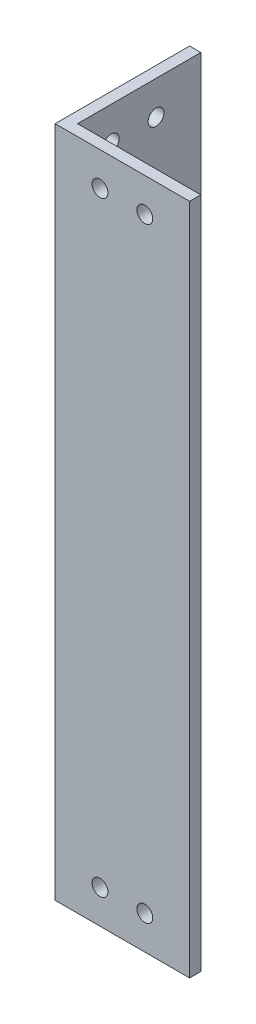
ISO-10303-21;
HEADER;
FILE_DESCRIPTION(('STEP AP214'),'2;1');
FILE_NAME('part.step','',(''),(''),'','','');
FILE_SCHEMA(('AUTOMOTIVE_DESIGN { 1 0 10303 214 1 1 1 1 }'));
ENDSEC;
DATA;
#1=APPLICATION_CONTEXT('core data for automotive mechanical design processes');
#2=APPLICATION_PROTOCOL_DEFINITION('international standard','automotive_design',2000,#1);
#3=PRODUCT_CONTEXT('',#1,'mechanical');
#4=PRODUCT('Part','Part','',(#3));
#5=PRODUCT_RELATED_PRODUCT_CATEGORY('part','',(#4));
#6=PRODUCT_DEFINITION_FORMATION('','',#4);
#7=PRODUCT_DEFINITION_CONTEXT('part definition',#1,'design');
#8=PRODUCT_DEFINITION('design','',#6,#7);
#9=PRODUCT_DEFINITION_SHAPE('','',#8);
#10=(LENGTH_UNIT() NAMED_UNIT(*) SI_UNIT(.MILLI.,.METRE.));
#11=(NAMED_UNIT(*) PLANE_ANGLE_UNIT() SI_UNIT($,.RADIAN.));
#12=(NAMED_UNIT(*) SI_UNIT($,.STERADIAN.) SOLID_ANGLE_UNIT());
#13=UNCERTAINTY_MEASURE_WITH_UNIT(LENGTH_MEASURE(1.E-05),#10,'distance_accuracy_value','');
#14=(GEOMETRIC_REPRESENTATION_CONTEXT(3) GLOBAL_UNCERTAINTY_ASSIGNED_CONTEXT((#13)) GLOBAL_UNIT_ASSIGNED_CONTEXT((#10,
#11,#12)) REPRESENTATION_CONTEXT('',''));
#15=CARTESIAN_POINT('',(0.,0.,0.));
#16=DIRECTION('',(0.,0.,1.));
#17=DIRECTION('',(1.,0.,0.));
#18=AXIS2_PLACEMENT_3D('',#15,#16,#17);
#19=CARTESIAN_POINT('',(0.,190.5,0.));
#20=DIRECTION('',(1.,0.,0.));
#21=DIRECTION('',(0.,0.,-1.));
#22=AXIS2_PLACEMENT_3D('',#19,#20,#21);
#23=PLANE('',#22);
#24=DIRECTION('',(0.,0.,1.));
#25=VECTOR('',#24,1.);
#26=CARTESIAN_POINT('',(0.,0.,0.));
#27=LINE('',#26,#25);
#28=CARTESIAN_POINT('',(0.,0.,-38.1));
#29=VERTEX_POINT('',#28);
#30=CARTESIAN_POINT('',(0.,0.,0.));
#31=VERTEX_POINT('',#30);
#32=EDGE_CURVE('E79',#29,#31,#27,.T.);
#33=ORIENTED_EDGE('',*,*,#32,.T.);
#34=DIRECTION('',(0.,-1.,0.));
#35=VECTOR('',#34,1.);
#36=CARTESIAN_POINT('',(0.,190.5,0.));
#37=LINE('',#36,#35);
#38=CARTESIAN_POINT('',(0.,190.5,0.));
#39=VERTEX_POINT('',#38);
#40=EDGE_CURVE('E114',#39,#31,#37,.T.);
#41=ORIENTED_EDGE('',*,*,#40,.F.);
#42=DIRECTION('',(0.,0.,1.));
#43=VECTOR('',#42,1.);
#44=CARTESIAN_POINT('',(0.,190.5,0.));
#45=LINE('',#44,#43);
#46=CARTESIAN_POINT('',(0.,190.5,-38.1));
#47=VERTEX_POINT('',#46);
#48=EDGE_CURVE('E50',#47,#39,#45,.T.);
#49=ORIENTED_EDGE('',*,*,#48,.F.);
#50=DIRECTION('',(0.,-1.,0.));
#51=VECTOR('',#50,1.);
#52=CARTESIAN_POINT('',(0.,190.5,-38.1));
#53=LINE('',#52,#51);
#54=EDGE_CURVE('E110',#47,#29,#53,.T.);
#55=ORIENTED_EDGE('',*,*,#54,.T.);
#56=EDGE_LOOP('',(#33,#41,#49,#55));
#57=FACE_BOUND('',#56,.T.);
#58=CARTESIAN_POINT('',(0.,9.525,-25.4));
#59=DIRECTION('',(-1.,0.,0.));
#60=DIRECTION('',(0.,0.,1.));
#61=AXIS2_PLACEMENT_3D('',#58,#59,#60);
#62=CIRCLE('',#61,2.24789999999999);
#63=CARTESIAN_POINT('',(0.,9.525,-23.1521));
#64=VERTEX_POINT('',#63);
#65=EDGE_CURVE('E148',#64,#64,#62,.T.);
#66=ORIENTED_EDGE('',*,*,#65,.F.);
#67=EDGE_LOOP('',(#66));
#68=FACE_BOUND('',#67,.T.);
#69=CARTESIAN_POINT('',(0.,9.525,-12.7));
#70=DIRECTION('',(-1.,0.,0.));
#71=DIRECTION('',(0.,0.,1.));
#72=AXIS2_PLACEMENT_3D('',#69,#70,#71);
#73=CIRCLE('',#72,2.24789999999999);
#74=CARTESIAN_POINT('',(0.,9.525,-10.4521));
#75=VERTEX_POINT('',#74);
#76=EDGE_CURVE('E152',#75,#75,#73,.T.);
#77=ORIENTED_EDGE('',*,*,#76,.F.);
#78=EDGE_LOOP('',(#77));
#79=FACE_BOUND('',#78,.T.);
#80=CARTESIAN_POINT('',(0.,180.975,-25.4));
#81=DIRECTION('',(-1.,0.,0.));
#82=DIRECTION('',(0.,0.,1.));
#83=AXIS2_PLACEMENT_3D('',#80,#81,#82);
#84=CIRCLE('',#83,2.2479);
#85=CARTESIAN_POINT('',(0.,180.975,-23.1521));
#86=VERTEX_POINT('',#85);
#87=EDGE_CURVE('E156',#86,#86,#84,.T.);
#88=ORIENTED_EDGE('',*,*,#87,.F.);
#89=EDGE_LOOP('',(#88));
#90=FACE_BOUND('',#89,.T.);
#91=CARTESIAN_POINT('',(0.,180.975,-12.7));
#92=DIRECTION('',(-1.,0.,0.));
#93=DIRECTION('',(0.,0.,1.));
#94=AXIS2_PLACEMENT_3D('',#91,#92,#93);
#95=CIRCLE('',#94,2.2479);
#96=CARTESIAN_POINT('',(0.,180.975,-10.4521));
#97=VERTEX_POINT('',#96);
#98=EDGE_CURVE('E159',#97,#97,#95,.T.);
#99=ORIENTED_EDGE('',*,*,#98,.F.);
#100=EDGE_LOOP('',(#99));
#101=FACE_BOUND('',#100,.T.);
#102=ADVANCED_FACE('F33',(#57,#68,#79,#90,#101),#23,.F.);
#103=CARTESIAN_POINT('',(38.1,190.5,0.));
#104=DIRECTION('',(0.,0.,-1.));
#105=DIRECTION('',(-1.,0.,0.));
#106=AXIS2_PLACEMENT_3D('',#103,#104,#105);
#107=PLANE('',#106);
#108=CARTESIAN_POINT('',(12.7,180.975,0.));
#109=DIRECTION('',(0.,0.,1.));
#110=DIRECTION('',(1.,0.,0.));
#111=AXIS2_PLACEMENT_3D('',#108,#109,#110);
#112=CIRCLE('',#111,2.24789999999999);
#113=CARTESIAN_POINT('',(14.9479,180.975,0.));
#114=VERTEX_POINT('',#113);
#115=EDGE_CURVE('E170',#114,#114,#112,.T.);
#116=ORIENTED_EDGE('',*,*,#115,.F.);
#117=EDGE_LOOP('',(#116));
#118=FACE_BOUND('',#117,.T.);
#119=CARTESIAN_POINT('',(25.4,180.975,0.));
#120=DIRECTION('',(0.,0.,1.));
#121=DIRECTION('',(1.,0.,0.));
#122=AXIS2_PLACEMENT_3D('',#119,#120,#121);
#123=CIRCLE('',#122,2.24789999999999);
#124=CARTESIAN_POINT('',(27.6479,180.975,0.));
#125=VERTEX_POINT('',#124);
#126=EDGE_CURVE('E176',#125,#125,#123,.T.);
#127=ORIENTED_EDGE('',*,*,#126,.F.);
#128=EDGE_LOOP('',(#127));
#129=FACE_BOUND('',#128,.T.);
#130=CARTESIAN_POINT('',(12.7,9.525,0.));
#131=DIRECTION('',(0.,0.,1.));
#132=DIRECTION('',(1.,0.,0.));
#133=AXIS2_PLACEMENT_3D('',#130,#131,#132);
#134=CIRCLE('',#133,2.24789999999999);
#135=CARTESIAN_POINT('',(14.9479,9.525,0.));
#136=VERTEX_POINT('',#135);
#137=EDGE_CURVE('E190',#136,#136,#134,.T.);
#138=ORIENTED_EDGE('',*,*,#137,.F.);
#139=EDGE_LOOP('',(#138));
#140=FACE_BOUND('',#139,.T.);
#141=CARTESIAN_POINT('',(25.4,9.525,0.));
#142=DIRECTION('',(0.,0.,1.));
#143=DIRECTION('',(1.,0.,0.));
#144=AXIS2_PLACEMENT_3D('',#141,#142,#143);
#145=CIRCLE('',#144,2.24789999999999);
#146=CARTESIAN_POINT('',(27.6479,9.525,0.));
#147=VERTEX_POINT('',#146);
#148=EDGE_CURVE('E196',#147,#147,#145,.T.);
#149=ORIENTED_EDGE('',*,*,#148,.F.);
#150=EDGE_LOOP('',(#149));
#151=FACE_BOUND('',#150,.T.);
#152=DIRECTION('',(1.,0.,0.));
#153=VECTOR('',#152,1.);
#154=CARTESIAN_POINT('',(38.1,0.,0.));
#155=LINE('',#154,#153);
#156=CARTESIAN_POINT('',(38.1,0.,0.));
#157=VERTEX_POINT('',#156);
#158=EDGE_CURVE('E118',#31,#157,#155,.T.);
#159=ORIENTED_EDGE('',*,*,#158,.T.);
#160=DIRECTION('',(0.,-1.,0.));
#161=VECTOR('',#160,1.);
#162=CARTESIAN_POINT('',(38.1,190.5,0.));
#163=LINE('',#162,#161);
#164=CARTESIAN_POINT('',(38.1,190.5,0.));
#165=VERTEX_POINT('',#164);
#166=EDGE_CURVE('E11',#165,#157,#163,.T.);
#167=ORIENTED_EDGE('',*,*,#166,.F.);
#168=DIRECTION('',(1.,0.,0.));
#169=VECTOR('',#168,1.);
#170=CARTESIAN_POINT('',(38.1,190.5,0.));
#171=LINE('',#170,#169);
#172=EDGE_CURVE('E129',#39,#165,#171,.T.);
#173=ORIENTED_EDGE('',*,*,#172,.F.);
#174=ORIENTED_EDGE('',*,*,#40,.T.);
#175=EDGE_LOOP('',(#159,#167,#173,#174));
#176=FACE_BOUND('',#175,.T.);
#177=ADVANCED_FACE('F35',(#118,#129,#140,#151,#176),#107,.F.);
#178=CARTESIAN_POINT('',(38.1,190.5,-3.175));
#179=DIRECTION('',(-1.,0.,0.));
#180=DIRECTION('',(0.,0.,1.));
#181=AXIS2_PLACEMENT_3D('',#178,#179,#180);
#182=PLANE('',#181);
#183=DIRECTION('',(0.,0.,-1.));
#184=VECTOR('',#183,1.);
#185=CARTESIAN_POINT('',(38.1,0.,-3.175));
#186=LINE('',#185,#184);
#187=CARTESIAN_POINT('',(38.1,0.,-3.175));
#188=VERTEX_POINT('',#187);
#189=EDGE_CURVE('E121',#157,#188,#186,.T.);
#190=ORIENTED_EDGE('',*,*,#189,.T.);
#191=DIRECTION('',(0.,-1.,0.));
#192=VECTOR('',#191,1.);
#193=CARTESIAN_POINT('',(38.1,190.5,-3.175));
#194=LINE('',#193,#192);
#195=CARTESIAN_POINT('',(38.1,190.5,-3.175));
#196=VERTEX_POINT('',#195);
#197=EDGE_CURVE('E42',#196,#188,#194,.T.);
#198=ORIENTED_EDGE('',*,*,#197,.F.);
#199=DIRECTION('',(0.,0.,-1.));
#200=VECTOR('',#199,1.);
#201=CARTESIAN_POINT('',(38.1,190.5,-3.175));
#202=LINE('',#201,#200);
#203=EDGE_CURVE('E87',#165,#196,#202,.T.);
#204=ORIENTED_EDGE('',*,*,#203,.F.);
#205=ORIENTED_EDGE('',*,*,#166,.T.);
#206=EDGE_LOOP('',(#190,#198,#204,#205));
#207=FACE_BOUND('',#206,.T.);
#208=ADVANCED_FACE('F213',(#207),#182,.F.);
#209=CARTESIAN_POINT('',(3.175,190.5,-3.175));
#210=DIRECTION('',(0.,0.,1.));
#211=DIRECTION('',(1.,0.,0.));
#212=AXIS2_PLACEMENT_3D('',#209,#210,#211);
#213=PLANE('',#212);
#214=CARTESIAN_POINT('',(12.7,180.975,-3.175));
#215=DIRECTION('',(0.,0.,1.));
#216=DIRECTION('',(1.,0.,0.));
#217=AXIS2_PLACEMENT_3D('',#214,#215,#216);
#218=CIRCLE('',#217,2.24789999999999);
#219=CARTESIAN_POINT('',(14.9479,180.975,-3.175));
#220=VERTEX_POINT('',#219);
#221=EDGE_CURVE('E173',#220,#220,#218,.T.);
#222=ORIENTED_EDGE('',*,*,#221,.T.);
#223=EDGE_LOOP('',(#222));
#224=FACE_BOUND('',#223,.T.);
#225=CARTESIAN_POINT('',(25.4,180.975,-3.175));
#226=DIRECTION('',(0.,0.,1.));
#227=DIRECTION('',(1.,0.,0.));
#228=AXIS2_PLACEMENT_3D('',#225,#226,#227);
#229=CIRCLE('',#228,2.24789999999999);
#230=CARTESIAN_POINT('',(27.6479,180.975,-3.175));
#231=VERTEX_POINT('',#230);
#232=EDGE_CURVE('E179',#231,#231,#229,.T.);
#233=ORIENTED_EDGE('',*,*,#232,.T.);
#234=EDGE_LOOP('',(#233));
#235=FACE_BOUND('',#234,.T.);
#236=CARTESIAN_POINT('',(12.7,9.525,-3.175));
#237=DIRECTION('',(0.,0.,1.));
#238=DIRECTION('',(1.,0.,0.));
#239=AXIS2_PLACEMENT_3D('',#236,#237,#238);
#240=CIRCLE('',#239,2.24789999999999);
#241=CARTESIAN_POINT('',(14.9479,9.525,-3.175));
#242=VERTEX_POINT('',#241);
#243=EDGE_CURVE('E193',#242,#242,#240,.T.);
#244=ORIENTED_EDGE('',*,*,#243,.T.);
#245=EDGE_LOOP('',(#244));
#246=FACE_BOUND('',#245,.T.);
#247=CARTESIAN_POINT('',(25.4,9.525,-3.175));
#248=DIRECTION('',(0.,0.,1.));
#249=DIRECTION('',(1.,0.,0.));
#250=AXIS2_PLACEMENT_3D('',#247,#248,#249);
#251=CIRCLE('',#250,2.24789999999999);
#252=CARTESIAN_POINT('',(27.6479,9.525,-3.175));
#253=VERTEX_POINT('',#252);
#254=EDGE_CURVE('E122',#253,#253,#251,.T.);
#255=ORIENTED_EDGE('',*,*,#254,.T.);
#256=EDGE_LOOP('',(#255));
#257=FACE_BOUND('',#256,.T.);
#258=DIRECTION('',(-1.,0.,0.));
#259=VECTOR('',#258,1.);
#260=CARTESIAN_POINT('',(3.175,0.,-3.175));
#261=LINE('',#260,#259);
#262=CARTESIAN_POINT('',(3.175,0.,-3.175));
#263=VERTEX_POINT('',#262);
#264=EDGE_CURVE('E124',#188,#263,#261,.T.);
#265=ORIENTED_EDGE('',*,*,#264,.T.);
#266=DIRECTION('',(0.,-1.,0.));
#267=VECTOR('',#266,1.);
#268=CARTESIAN_POINT('',(3.175,190.5,-3.175));
#269=LINE('',#268,#267);
#270=CARTESIAN_POINT('',(3.175,190.5,-3.175));
#271=VERTEX_POINT('',#270);
#272=EDGE_CURVE('E109',#271,#263,#269,.T.);
#273=ORIENTED_EDGE('',*,*,#272,.F.);
#274=DIRECTION('',(-1.,0.,0.));
#275=VECTOR('',#274,1.);
#276=CARTESIAN_POINT('',(3.175,190.5,-3.175));
#277=LINE('',#276,#275);
#278=EDGE_CURVE('E100',#196,#271,#277,.T.);
#279=ORIENTED_EDGE('',*,*,#278,.F.);
#280=ORIENTED_EDGE('',*,*,#197,.T.);
#281=EDGE_LOOP('',(#265,#273,#279,#280));
#282=FACE_BOUND('',#281,.T.);
#283=ADVANCED_FACE('F135',(#224,#235,#246,#257,#282),#213,.F.);
#284=CARTESIAN_POINT('',(3.175,190.5,-38.1));
#285=DIRECTION('',(-1.,0.,0.));
#286=DIRECTION('',(0.,0.,1.));
#287=AXIS2_PLACEMENT_3D('',#284,#285,#286);
#288=PLANE('',#287);
#289=CARTESIAN_POINT('',(3.175,180.975,-12.7));
#290=DIRECTION('',(-1.,0.,0.));
#291=DIRECTION('',(0.,0.,1.));
#292=AXIS2_PLACEMENT_3D('',#289,#290,#291);
#293=CIRCLE('',#292,2.2479);
#294=CARTESIAN_POINT('',(3.175,180.975,-10.4521));
#295=VERTEX_POINT('',#294);
#296=EDGE_CURVE('E161',#295,#295,#293,.T.);
#297=ORIENTED_EDGE('',*,*,#296,.T.);
#298=EDGE_LOOP('',(#297));
#299=FACE_BOUND('',#298,.T.);
#300=CARTESIAN_POINT('',(3.175,180.975,-25.4));
#301=DIRECTION('',(-1.,0.,0.));
#302=DIRECTION('',(0.,0.,1.));
#303=AXIS2_PLACEMENT_3D('',#300,#301,#302);
#304=CIRCLE('',#303,2.2479);
#305=CARTESIAN_POINT('',(3.175,180.975,-23.1521));
#306=VERTEX_POINT('',#305);
#307=EDGE_CURVE('E167',#306,#306,#304,.T.);
#308=ORIENTED_EDGE('',*,*,#307,.T.);
#309=EDGE_LOOP('',(#308));
#310=FACE_BOUND('',#309,.T.);
#311=CARTESIAN_POINT('',(3.175,9.525,-12.7));
#312=DIRECTION('',(-1.,0.,0.));
#313=DIRECTION('',(0.,0.,1.));
#314=AXIS2_PLACEMENT_3D('',#311,#312,#313);
#315=CIRCLE('',#314,2.24789999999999);
#316=CARTESIAN_POINT('',(3.175,9.525,-10.4521));
#317=VERTEX_POINT('',#316);
#318=EDGE_CURVE('E183',#317,#317,#315,.T.);
#319=ORIENTED_EDGE('',*,*,#318,.T.);
#320=EDGE_LOOP('',(#319));
#321=FACE_BOUND('',#320,.T.);
#322=CARTESIAN_POINT('',(3.175,9.525,-25.4));
#323=DIRECTION('',(-1.,0.,0.));
#324=DIRECTION('',(0.,0.,1.));
#325=AXIS2_PLACEMENT_3D('',#322,#323,#324);
#326=CIRCLE('',#325,2.24789999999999);
#327=CARTESIAN_POINT('',(3.175,9.525,-23.1521));
#328=VERTEX_POINT('',#327);
#329=EDGE_CURVE('E187',#328,#328,#326,.T.);
#330=ORIENTED_EDGE('',*,*,#329,.T.);
#331=EDGE_LOOP('',(#330));
#332=FACE_BOUND('',#331,.T.);
#333=DIRECTION('',(0.,0.,-1.));
#334=VECTOR('',#333,1.);
#335=CARTESIAN_POINT('',(3.175,0.,-38.1));
#336=LINE('',#335,#334);
#337=CARTESIAN_POINT('',(3.175,0.,-38.1));
#338=VERTEX_POINT('',#337);
#339=EDGE_CURVE('E108',#263,#338,#336,.T.);
#340=ORIENTED_EDGE('',*,*,#339,.T.);
#341=DIRECTION('',(0.,-1.,0.));
#342=VECTOR('',#341,1.);
#343=CARTESIAN_POINT('',(3.175,190.5,-38.1));
#344=LINE('',#343,#342);
#345=CARTESIAN_POINT('',(3.175,190.5,-38.1));
#346=VERTEX_POINT('',#345);
#347=EDGE_CURVE('E105',#346,#338,#344,.T.);
#348=ORIENTED_EDGE('',*,*,#347,.F.);
#349=DIRECTION('',(0.,0.,-1.));
#350=VECTOR('',#349,1.);
#351=CARTESIAN_POINT('',(3.175,190.5,-38.1));
#352=LINE('',#351,#350);
#353=EDGE_CURVE('E94',#271,#346,#352,.T.);
#354=ORIENTED_EDGE('',*,*,#353,.F.);
#355=ORIENTED_EDGE('',*,*,#272,.T.);
#356=EDGE_LOOP('',(#340,#348,#354,#355));
#357=FACE_BOUND('',#356,.T.);
#358=ADVANCED_FACE('F106',(#299,#310,#321,#332,#357),#288,.F.);
#359=CARTESIAN_POINT('',(0.,190.5,-38.1));
#360=DIRECTION('',(0.,0.,1.));
#361=DIRECTION('',(1.,0.,0.));
#362=AXIS2_PLACEMENT_3D('',#359,#360,#361);
#363=PLANE('',#362);
#364=DIRECTION('',(-1.,0.,0.));
#365=VECTOR('',#364,1.);
#366=CARTESIAN_POINT('',(0.,0.,-38.1));
#367=LINE('',#366,#365);
#368=EDGE_CURVE('E73',#338,#29,#367,.T.);
#369=ORIENTED_EDGE('',*,*,#368,.T.);
#370=ORIENTED_EDGE('',*,*,#54,.F.);
#371=DIRECTION('',(-1.,0.,0.));
#372=VECTOR('',#371,1.);
#373=CARTESIAN_POINT('',(0.,190.5,-38.1));
#374=LINE('',#373,#372);
#375=EDGE_CURVE('E98',#346,#47,#374,.T.);
#376=ORIENTED_EDGE('',*,*,#375,.F.);
#377=ORIENTED_EDGE('',*,*,#347,.T.);
#378=EDGE_LOOP('',(#369,#370,#376,#377));
#379=FACE_BOUND('',#378,.T.);
#380=ADVANCED_FACE('F112',(#379),#363,.F.);
#381=CARTESIAN_POINT('',(0.,190.5,0.));
#382=DIRECTION('',(0.,-1.,0.));
#383=DIRECTION('',(0.,0.,-1.));
#384=AXIS2_PLACEMENT_3D('',#381,#382,#383);
#385=PLANE('',#384);
#386=ORIENTED_EDGE('',*,*,#172,.T.);
#387=ORIENTED_EDGE('',*,*,#203,.T.);
#388=ORIENTED_EDGE('',*,*,#278,.T.);
#389=ORIENTED_EDGE('',*,*,#353,.T.);
#390=ORIENTED_EDGE('',*,*,#375,.T.);
#391=ORIENTED_EDGE('',*,*,#48,.T.);
#392=EDGE_LOOP('',(#386,#387,#388,#389,#390,#391));
#393=FACE_BOUND('',#392,.T.);
#394=ADVANCED_FACE('F96',(#393),#385,.F.);
#395=CARTESIAN_POINT('',(0.,0.,0.));
#396=DIRECTION('',(0.,-1.,0.));
#397=DIRECTION('',(0.,0.,-1.));
#398=AXIS2_PLACEMENT_3D('',#395,#396,#397);
#399=PLANE('',#398);
#400=ORIENTED_EDGE('',*,*,#158,.F.);
#401=ORIENTED_EDGE('',*,*,#32,.F.);
#402=ORIENTED_EDGE('',*,*,#368,.F.);
#403=ORIENTED_EDGE('',*,*,#339,.F.);
#404=ORIENTED_EDGE('',*,*,#264,.F.);
#405=ORIENTED_EDGE('',*,*,#189,.F.);
#406=EDGE_LOOP('',(#400,#401,#402,#403,#404,#405));
#407=FACE_BOUND('',#406,.T.);
#408=ADVANCED_FACE('F138',(#407),#399,.T.);
#409=CARTESIAN_POINT('',(25.4,9.525,0.));
#410=DIRECTION('',(0.,0.,1.));
#411=DIRECTION('',(1.,0.,0.));
#412=AXIS2_PLACEMENT_3D('',#409,#410,#411);
#413=CYLINDRICAL_SURFACE('',#412,2.24789999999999);
#414=ORIENTED_EDGE('',*,*,#254,.F.);
#415=EDGE_LOOP('',(#414));
#416=FACE_BOUND('',#415,.T.);
#417=ORIENTED_EDGE('',*,*,#148,.T.);
#418=EDGE_LOOP('',(#417));
#419=FACE_BOUND('',#418,.T.);
#420=ADVANCED_FACE('F205',(#416,#419),#413,.F.);
#421=CARTESIAN_POINT('',(12.7,9.525,0.));
#422=DIRECTION('',(0.,0.,1.));
#423=DIRECTION('',(1.,0.,0.));
#424=AXIS2_PLACEMENT_3D('',#421,#422,#423);
#425=CYLINDRICAL_SURFACE('',#424,2.24789999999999);
#426=ORIENTED_EDGE('',*,*,#243,.F.);
#427=EDGE_LOOP('',(#426));
#428=FACE_BOUND('',#427,.T.);
#429=ORIENTED_EDGE('',*,*,#137,.T.);
#430=EDGE_LOOP('',(#429));
#431=FACE_BOUND('',#430,.T.);
#432=ADVANCED_FACE('F208',(#428,#431),#425,.F.);
#433=CARTESIAN_POINT('',(0.,9.525,-25.4));
#434=DIRECTION('',(-1.,0.,0.));
#435=DIRECTION('',(0.,0.,1.));
#436=AXIS2_PLACEMENT_3D('',#433,#434,#435);
#437=CYLINDRICAL_SURFACE('',#436,2.24789999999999);
#438=ORIENTED_EDGE('',*,*,#329,.F.);
#439=EDGE_LOOP('',(#438));
#440=FACE_BOUND('',#439,.T.);
#441=ORIENTED_EDGE('',*,*,#65,.T.);
#442=EDGE_LOOP('',(#441));
#443=FACE_BOUND('',#442,.T.);
#444=ADVANCED_FACE('F225',(#440,#443),#437,.F.);
#445=CARTESIAN_POINT('',(0.,9.525,-12.7));
#446=DIRECTION('',(-1.,0.,0.));
#447=DIRECTION('',(0.,0.,1.));
#448=AXIS2_PLACEMENT_3D('',#445,#446,#447);
#449=CYLINDRICAL_SURFACE('',#448,2.24789999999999);
#450=ORIENTED_EDGE('',*,*,#318,.F.);
#451=EDGE_LOOP('',(#450));
#452=FACE_BOUND('',#451,.T.);
#453=ORIENTED_EDGE('',*,*,#76,.T.);
#454=EDGE_LOOP('',(#453));
#455=FACE_BOUND('',#454,.T.);
#456=ADVANCED_FACE('F231',(#452,#455),#449,.F.);
#457=CARTESIAN_POINT('',(25.4,180.975,0.));
#458=DIRECTION('',(0.,0.,1.));
#459=DIRECTION('',(1.,0.,0.));
#460=AXIS2_PLACEMENT_3D('',#457,#458,#459);
#461=CYLINDRICAL_SURFACE('',#460,2.24789999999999);
#462=ORIENTED_EDGE('',*,*,#232,.F.);
#463=EDGE_LOOP('',(#462));
#464=FACE_BOUND('',#463,.T.);
#465=ORIENTED_EDGE('',*,*,#126,.T.);
#466=EDGE_LOOP('',(#465));
#467=FACE_BOUND('',#466,.T.);
#468=ADVANCED_FACE('F255',(#464,#467),#461,.F.);
#469=CARTESIAN_POINT('',(12.7,180.975,0.));
#470=DIRECTION('',(0.,0.,1.));
#471=DIRECTION('',(1.,0.,0.));
#472=AXIS2_PLACEMENT_3D('',#469,#470,#471);
#473=CYLINDRICAL_SURFACE('',#472,2.24789999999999);
#474=ORIENTED_EDGE('',*,*,#221,.F.);
#475=EDGE_LOOP('',(#474));
#476=FACE_BOUND('',#475,.T.);
#477=ORIENTED_EDGE('',*,*,#115,.T.);
#478=EDGE_LOOP('',(#477));
#479=FACE_BOUND('',#478,.T.);
#480=ADVANCED_FACE('F258',(#476,#479),#473,.F.);
#481=CARTESIAN_POINT('',(0.,180.975,-25.4));
#482=DIRECTION('',(-1.,0.,0.));
#483=DIRECTION('',(0.,0.,1.));
#484=AXIS2_PLACEMENT_3D('',#481,#482,#483);
#485=CYLINDRICAL_SURFACE('',#484,2.2479);
#486=ORIENTED_EDGE('',*,*,#307,.F.);
#487=EDGE_LOOP('',(#486));
#488=FACE_BOUND('',#487,.T.);
#489=ORIENTED_EDGE('',*,*,#87,.T.);
#490=EDGE_LOOP('',(#489));
#491=FACE_BOUND('',#490,.T.);
#492=ADVANCED_FACE('F264',(#488,#491),#485,.F.);
#493=CARTESIAN_POINT('',(0.,180.975,-12.7));
#494=DIRECTION('',(-1.,0.,0.));
#495=DIRECTION('',(0.,0.,1.));
#496=AXIS2_PLACEMENT_3D('',#493,#494,#495);
#497=CYLINDRICAL_SURFACE('',#496,2.2479);
#498=ORIENTED_EDGE('',*,*,#296,.F.);
#499=EDGE_LOOP('',(#498));
#500=FACE_BOUND('',#499,.T.);
#501=ORIENTED_EDGE('',*,*,#98,.T.);
#502=EDGE_LOOP('',(#501));
#503=FACE_BOUND('',#502,.T.);
#504=ADVANCED_FACE('F271',(#500,#503),#497,.F.);
#505=CLOSED_SHELL('',(#102,#177,#208,#283,#358,#380,#394,#408,#420,#432,#444,#456,#468,#480,
#492,#504));
#506=MANIFOLD_SOLID_BREP('B2',#505);
#507=ADVANCED_BREP_SHAPE_REPRESENTATION('',(#18,#506),#14);
#508=SHAPE_DEFINITION_REPRESENTATION(#9,#507);
ENDSEC;
END-ISO-10303-21;
